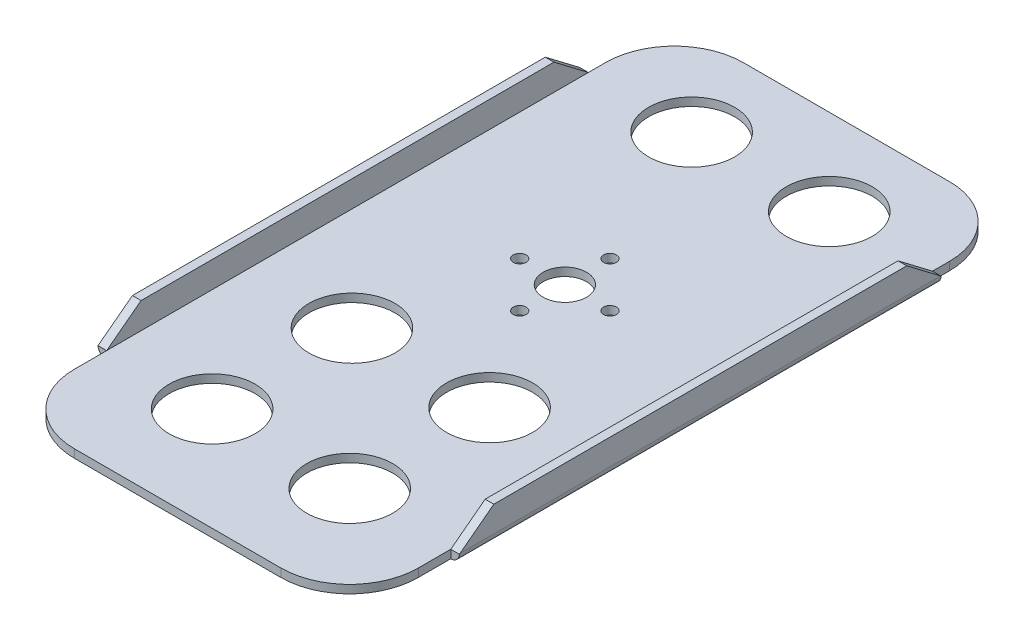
from build123d import *

# Parameters (mm, degrees)
SKETCH1_R               = 7.9375
SKETCH1_R_2             = 4.0005
SKETCH1_R_3             = 1.1938
EXTRUDE1_DEPTH          = 1.524
EXTRUDE2_DEPTH          = 6.35
CUT_EXTRUDE1_DEPTH      = 80.12850141
CUT_EXTRUDE1_DEPTH_BACK = 80.12850141
FILLET1_R               = 1.5875


with BuildPart() as part:
    # Sketch1 → Extrude1 (new body)
    with BuildSketch(Plane(origin=(0, 0, 0), x_dir=(1, 0, 0), z_dir=(0, 1, 0))):
        with BuildLine():
            Line((-31.75, -3.2004), (-31.75, -58.7756))
            ThreePointArc((-31.75, -58.7756), (-28.030256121, -67.755856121), (-19.05, -71.4756))
            Line((-19.05, -71.4756), (19.05, -71.4756))
            ThreePointArc((19.05, -71.4756), (28.030256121, -67.755856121), (31.75, -58.7756))
            Line((31.75, -58.7756), (31.75, -3.2004))
            Line((31.75, -3.2004), (31.75, 39.2684))
            ThreePointArc((31.75, 39.2684), (28.030256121, 48.248656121), (19.05, 51.9684))
            Line((19.05, 51.9684), (12.7, 51.9684))
            Line((12.7, 51.9684), (-12.7, 51.9684))
            Line((-12.7, 51.9684), (-19.05, 51.9684))
            ThreePointArc((-19.05, 51.9684), (-28.030256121, 48.248656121), (-31.75, 39.2684))
            Line((-31.75, 39.2684), (-31.75, -3.2004))
        make_face()
        with Locations(Location((-12.7, -52.4002, 0), (0, 0, 90))):
            Circle(SKETCH1_R, mode=Mode.SUBTRACT)
        with Locations(Location((-12.7, 36.0934, 0), (0, 0, 90))):
            Circle(SKETCH1_R, mode=Mode.SUBTRACT)
        with Locations(Location((12.7, -52.4002, 0), (0, 0, 90))):
            Circle(SKETCH1_R, mode=Mode.SUBTRACT)
        with Locations(Location((12.7, -26.5938, 0), (0, 0, 90))):
            Circle(SKETCH1_R, mode=Mode.SUBTRACT)
        with Locations(Location((12.7, 36.0934, 0), (0, 0, 90))):
            Circle(SKETCH1_R, mode=Mode.SUBTRACT)
        with Locations(Location((0, 0, 0), (0, 0, 90))):
            Circle(SKETCH1_R_2, mode=Mode.SUBTRACT)
        with Locations(Location((8.3312, 0, 0), (0, 0, 90))):
            Circle(SKETCH1_R_3, mode=Mode.SUBTRACT)
        with Locations(Location((0, -8.3312, 0), (0, 0, 90))):
            Circle(SKETCH1_R_3, mode=Mode.SUBTRACT)
        with Locations(Location((0, 8.3312, 0), (0, 0, 90))):
            Circle(SKETCH1_R_3, mode=Mode.SUBTRACT)
        with Locations(Location((-8.3312, 0, 0), (0, 0, 90))):
            Circle(SKETCH1_R_3, mode=Mode.SUBTRACT)
        with Locations(Location((-12.7, -26.5938, 0), (0, 0, 90))):
            Circle(SKETCH1_R, mode=Mode.SUBTRACT)
    extrude(amount=EXTRUDE1_DEPTH)

    # Sketch1_3 → Extrude2 (add)
    with BuildSketch(Plane(origin=(0, 0, 0), x_dir=(1, 0, 0), z_dir=(0, 1, 0))):
        Polygon((31.75, 36.0934), (31.75, -3.2004), (31.75, -52.8066), (33.3502, -52.8066), (33.3502, 36.0934), align=None)
        Polygon((-33.3502, -52.8066), (-31.75, -52.8066), (-31.75, -3.2004), (-31.75, 36.0934), (-33.3502, 36.0934), align=None)
    extrude(amount=EXTRUDE2_DEPTH)

    # Sketch2 → Cut-Extrude1 (cut, two sides: drawn at the far end of the back side and taken through both)
    with BuildSketch(Plane(origin=(0, 0, 0), x_dir=(0, 0, -1), z_dir=(1, 0, 0)).offset(-CUT_EXTRUDE1_DEPTH_BACK)):
        Polygon((-52.8066, 1.524), (-46.4566, 6.35), (-52.8066, 6.35), align=None)
        Polygon((36.0934, 6.35), (36.0934, 1.524), (29.7434, 6.35), align=None)
    extrude(amount=CUT_EXTRUDE1_DEPTH + CUT_EXTRUDE1_DEPTH_BACK, mode=Mode.SUBTRACT)

    # Fillet1
    fillet1_edges = [part.edges().sort_by_distance(p)[0] for p in [
        (-33.3502, 0, 8.3566),
        (33.3502, 0, 8.3566),
    ]]
    fillet(fillet1_edges, radius=FILLET1_R)


solid = part.part
